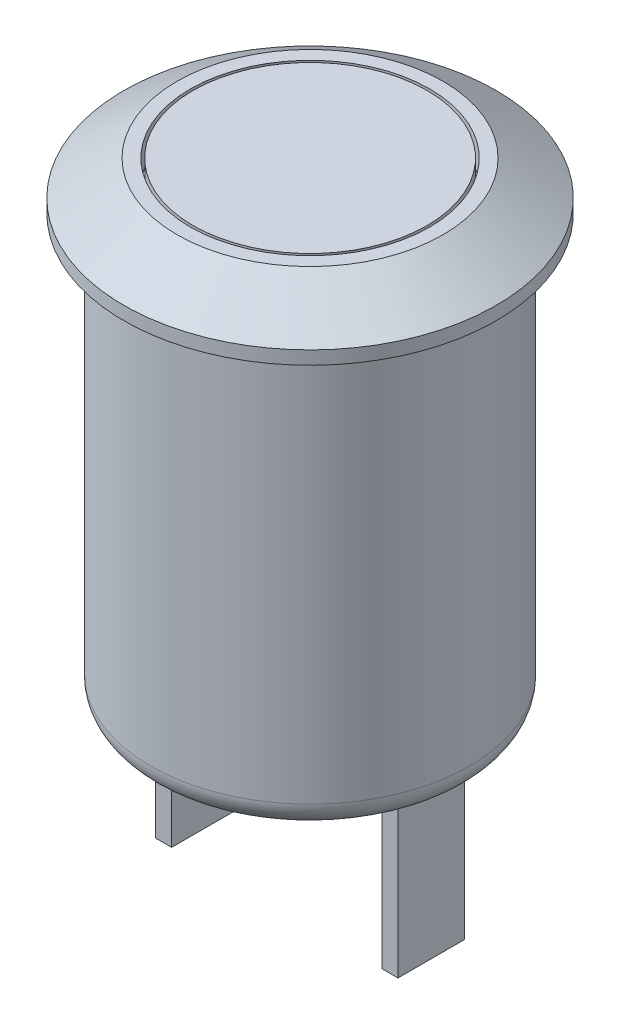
from build123d import *

# Parameters (mm, degrees)
CONG_1_R           = 1
ESQUISSE2_W        = 0.6
ESQUISSE2_H        = 2.5
BOSS_EXTRU_1_DEPTH = 6


with BuildPart() as part:
    # Esquisse1 → R_volution1 (revolve)
    with BuildSketch(Plane.XY, mode=Mode.PRIVATE) as r_volution1_sk:
        Polygon((0, 0), (0, 1.8), (4.4, 1.8), (4.4, 0.8), (4.5, 0.8), (4.5, 1.8), (5, 1.8), (7, 0.5), (7, 0), (6, 0), (6, -16), (0, -16), align=None)
    revolve(r_volution1_sk.sketch.rotate(Axis((0, 0, 0), (0, 1, 0)), 90), axis=Axis((0, 0, 0), (0, 1, 0)))

    # Cong_1
    cong_1_edges = [part.edges().sort_by_distance(p)[0] for p in [
        (0, -16, 6),
    ]]
    fillet(cong_1_edges, radius=CONG_1_R)

    # Esquisse2 → Boss.-Extru.1 (add)
    with BuildSketch(Plane.XZ.offset(16)):
        with Locations((-4.254347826, 0)):
            Rectangle(ESQUISSE2_W, ESQUISSE2_H)
        with Locations((4.254347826, 0)):
            Rectangle(ESQUISSE2_W, ESQUISSE2_H)
    extrude(amount=BOSS_EXTRU_1_DEPTH)


solid = part.part
